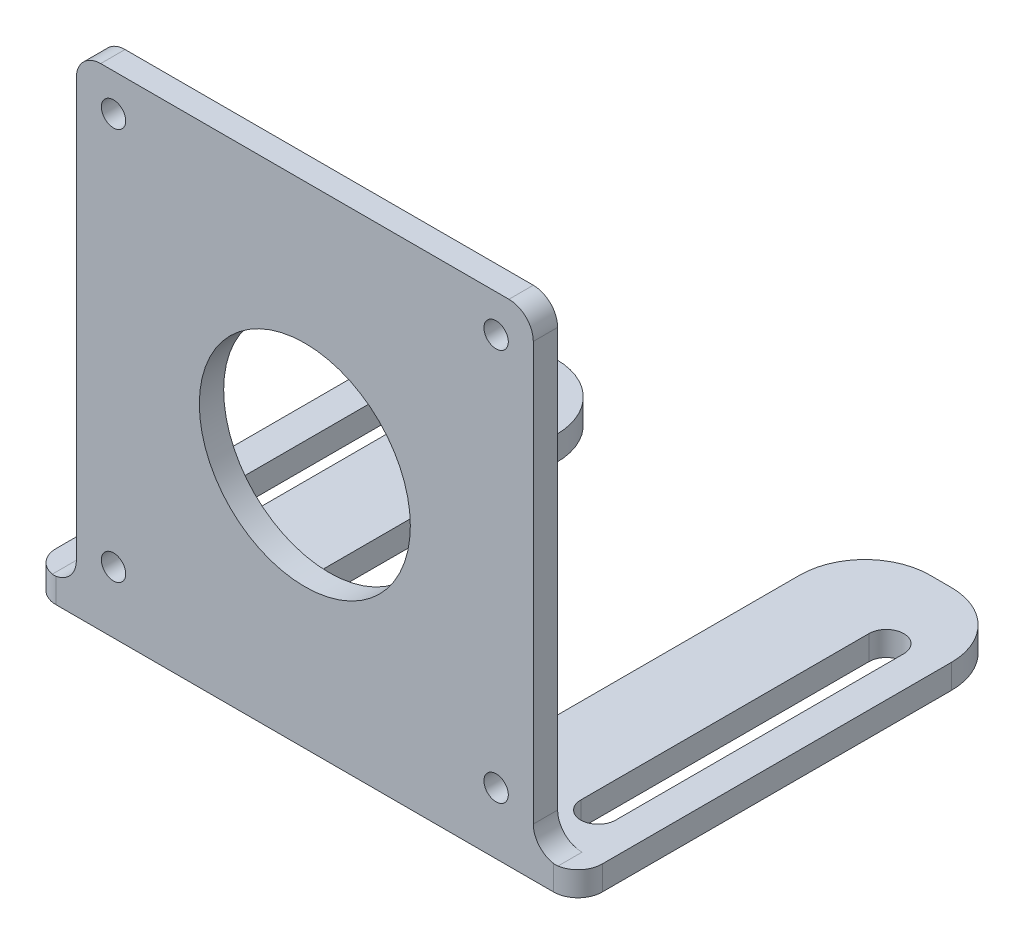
from build123d import *

# Parameters (mm, degrees)
ESQUISSE1_W             = 56.3
ESQUISSE1_H             = 60.5
ESQUISSE1_R             = 13
BOSS_EXTRU_1_DEPTH      = 3
BOSS_EXTRU_3_DEPTH      = 51
BOSS_EXTRU_3_DEPTH_BACK = 3
ESQUISSE2_W             = 56.3
ESQUISSE2_H             = 3
ESQUISSE7_W             = 54
ESQUISSE7_H             = 3
BOSS_EXTRU_4_DEPTH      = 5.5
ESQUISSE8_W             = 54
ESQUISSE8_H             = 3
BOSS_EXTRU_5_DEPTH      = 5.5
ENL_V_MAT_EXTRU_2_DEPTH = 51
CONG_2_R                = 3
CONG_3_R                = 8
ESQUISSE9_W             = 30
ESQUISSE9_H             = 46.163528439
ENL_V_MAT_EXTRU_3_DEPTH = 84.902160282
CONG_4_R                = 5
ESQUISSE10_W            = 6.464571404
ESQUISSE10_H            = 57.5
ESQUISSE10_W_2          = 8.273670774
ENL_V_MAT_EXTRU_4_DEPTH = 69.179065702
CONG_7_R                = 8
ESQUISSE11_W            = 3
ESQUISSE11_H            = 57.5
BOSS_EXTRU_6_DEPTH      = 4.5
ESQUISSE12_W            = 3
ESQUISSE12_H            = 57.5
BOSS_EXTRU_7_DEPTH      = 4.5
ESQUISSE13_R            = 1.5
ENL_V_MAT_EXTRU_5_DEPTH = 69.179065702
CONG_8_R                = 3


with BuildPart() as part:
    # Esquisse1 → Boss.-Extru.1 (new body)
    with BuildSketch(Plane.XY):
        Rectangle(ESQUISSE1_W, ESQUISSE1_H)
        Circle(ESQUISSE1_R, mode=Mode.SUBTRACT)
    extrude(amount=BOSS_EXTRU_1_DEPTH)

    # Esquisse2 → Boss.-Extru.3 (add, two sides: drawn at the far end of the back side and taken through both)
    with BuildSketch(Plane(origin=(0, 0, 0), x_dir=(-1, 0, 0), z_dir=(0, 0, -1)).offset(-BOSS_EXTRU_3_DEPTH_BACK)):
        with Locations((0, -28.75)):
            Rectangle(ESQUISSE2_W, ESQUISSE2_H)
    extrude(amount=BOSS_EXTRU_3_DEPTH + BOSS_EXTRU_3_DEPTH_BACK)

    # Esquisse7 → Boss.-Extru.4 (add)
    with BuildSketch(Plane.ZY.offset(28.15)):
        with Locations((-24, -28.75)):
            Rectangle(ESQUISSE7_W, ESQUISSE7_H)
    extrude(amount=BOSS_EXTRU_4_DEPTH)

    # Esquisse8 → Boss.-Extru.5 (add)
    with BuildSketch(Plane(origin=(28.15, 0, 0), x_dir=(0, 0, -1), z_dir=(1, 0, 0))):
        with Locations((24, -28.75)):
            Rectangle(ESQUISSE8_W, ESQUISSE8_H)
    extrude(amount=BOSS_EXTRU_5_DEPTH)

    # Esquisse6 → Enl_v. mat.-Extru.2 (cut)
    with BuildSketch(Plane(origin=(0, -27.25, 0), x_dir=(1, 0, 0), z_dir=(0, 1, 0))):
        with BuildLine():
            Line((25.5, 5.5), (25.5, 41))
            ThreePointArc((25.5, 41), (27.65, 43.15), (29.8, 41))
            Line((29.8, 41), (29.8, 5.5))
            ThreePointArc((29.8, 5.5), (27.65, 3.35), (25.5, 5.5))
        make_face()
        with BuildLine():
            Line((-29.8, 5.5), (-29.8, 41))
            ThreePointArc((-29.8, 41), (-27.65, 43.15), (-25.5, 41))
            Line((-25.5, 41), (-25.5, 5.5))
            ThreePointArc((-25.5, 5.5), (-27.65, 3.35), (-29.8, 5.5))
        make_face()
    extrude(amount=-ENL_V_MAT_EXTRU_2_DEPTH, mode=Mode.SUBTRACT)

    # Cong_2
    cong_2_edges = [part.edges().sort_by_distance(p)[0] for p in [
        (33.65, -28.75, 3),
        (-33.65, -28.75, 3),
    ]]
    fillet(cong_2_edges, radius=CONG_2_R)

    # Cong_3
    cong_3_edges = [part.edges().sort_by_distance(p)[0] for p in [
        (-33.65, -28.75, -51),
        (33.65, -28.75, -51),
    ]]
    fillet(cong_3_edges, radius=CONG_3_R)

    # Esquisse9 → Enl_v. mat.-Extru.3 (cut, through all)
    with BuildSketch(Plane(origin=(0, -27.25, 0), x_dir=(1, 0, 0), z_dir=(0, 1, 0))):
        with Locations((0, 31.08176422)):
            Rectangle(ESQUISSE9_W, ESQUISSE9_H)
    extrude(amount=-ENL_V_MAT_EXTRU_3_DEPTH, mode=Mode.SUBTRACT)

    # Cong_4
    cong_4_edges = [part.edges().sort_by_distance(p)[0] for p in [
        (-15, -28.75, -8),
        (15, -28.75, -8),
    ]]
    fillet(cong_4_edges, radius=CONG_4_R)

    # Esquisse10 → Enl_v. mat.-Extru.4 (cut, through all)
    with BuildSketch(Plane(origin=(0, 0, 0), x_dir=(-1, 0, 0), z_dir=(0, 0, -1))):
        with Locations((-26.882285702, 1.5)):
            Rectangle(ESQUISSE10_W, ESQUISSE10_H)
        with Locations((27.786835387, 1.5)):
            Rectangle(ESQUISSE10_W_2, ESQUISSE10_H)
    extrude(amount=-ENL_V_MAT_EXTRU_4_DEPTH, mode=Mode.SUBTRACT)

    # Cong_7
    cong_7_edges = [part.edges().sort_by_distance(p)[0] for p in [
        (15, -28.75, -51),
        (-15, -28.75, -51),
    ]]
    fillet(cong_7_edges, radius=CONG_7_R)

    # Esquisse11 → Boss.-Extru.6 (add)
    with BuildSketch(Plane.ZY.offset(23.65)):
        with Locations((1.5, 1.5)):
            Rectangle(ESQUISSE11_W, ESQUISSE11_H)
    extrude(amount=BOSS_EXTRU_6_DEPTH)

    # Esquisse12 → Boss.-Extru.7 (add)
    with BuildSketch(Plane(origin=(23.65, 0, 0), x_dir=(0, 0, -1), z_dir=(1, 0, 0))):
        with Locations((-1.5, 1.5)):
            Rectangle(ESQUISSE12_W, ESQUISSE12_H)
    extrude(amount=BOSS_EXTRU_7_DEPTH)

    # Esquisse13 → Enl_v. mat.-Extru.5 (cut, through all)
    with BuildSketch(Plane(origin=(0, 0, 0), x_dir=(-1, 0, 0), z_dir=(0, 0, -1))):
        with Locations((-23.57, 25.67)):
            Circle(ESQUISSE13_R)
        with Locations((23.57, 25.67)):
            Circle(ESQUISSE13_R)
        with Locations((23.57, -22.67)):
            Circle(ESQUISSE13_R)
        with Locations((-23.57, -22.67)):
            Circle(ESQUISSE13_R)
    extrude(amount=-ENL_V_MAT_EXTRU_5_DEPTH, mode=Mode.SUBTRACT)

    # Cong_8
    cong_8_edges = [part.edges().sort_by_distance(p)[0] for p in [
        (-28.15, -27.25, 1.5),
        (28.15, -27.25, 1.5),
        (28.15, 30.25, 1.5),
        (-28.15, 30.25, 1.5),
    ]]
    fillet(cong_8_edges, radius=CONG_8_R)


solid = part.part
